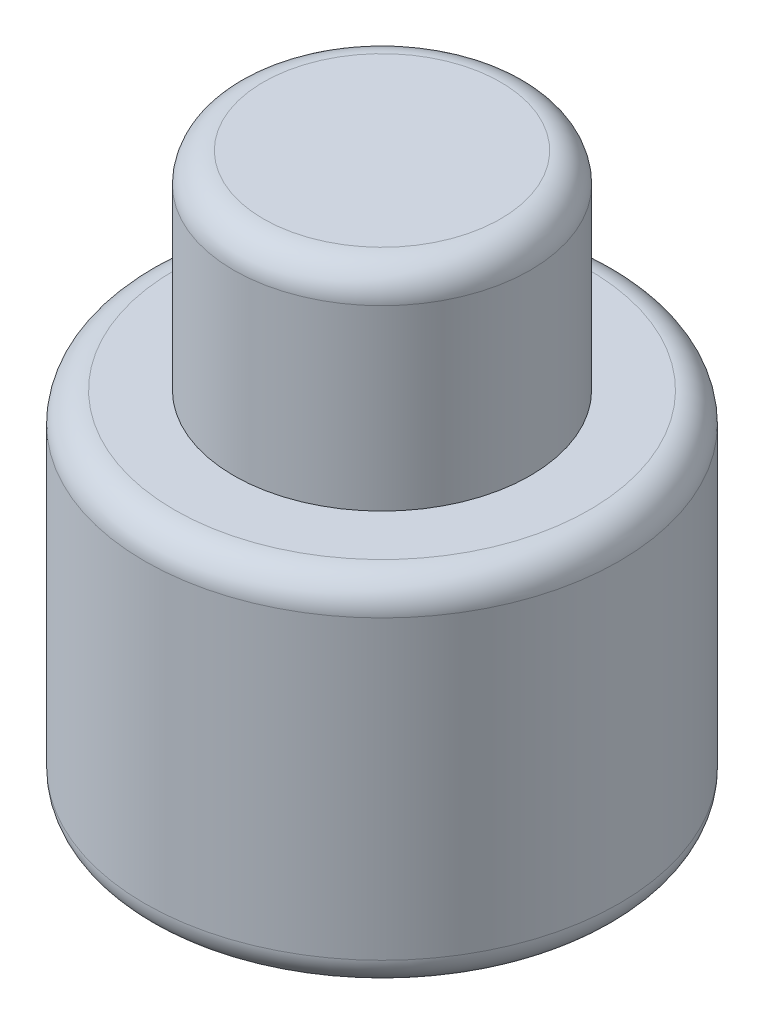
from build123d import *

# Parameters (mm, degrees)
CONG_1_R = 0.5


with BuildPart() as part:
    # Esquisse1 → R_volution1 (revolve)
    with BuildSketch(Plane.XY, mode=Mode.PRIVATE) as r_volution1_sk:
        Polygon((0, 0), (0, 9.5), (2.5, 9.5), (2.5, 6), (4, 6), (4, 0), align=None)
    revolve(r_volution1_sk.sketch.rotate(Axis((0, 0, 0), (0, 1, 0)), 90), axis=Axis((0, 0, 0), (0, 1, 0)))

    # Cong_1
    cong_1_edges = [part.edges().sort_by_distance(p)[0] for p in [
        (0, 0, 4),
        (0, 6, 4),
        (0, 9.5, 2.5),
    ]]
    fillet(cong_1_edges, radius=CONG_1_R)


solid = part.part
